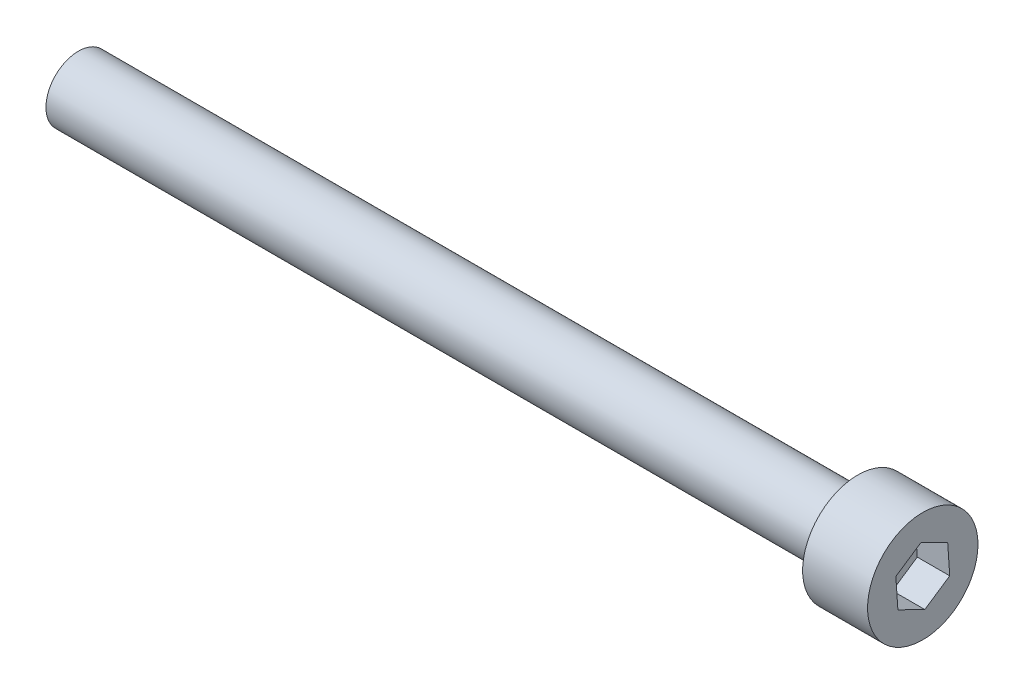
from build123d import *

# Parameters (mm, degrees)
ENL_V_MAT_EXTRU_1_DEPTH = 2.5


with BuildPart() as part:
    # Esquisse1 → R_volution1 (revolve)
    with BuildSketch(Plane.XY, mode=Mode.PRIVATE) as r_volution1_sk:
        Polygon((0, 0), (0, 4.25), (-5, 4.25), (-5, 2.5), (-65, 2.5), (-65, 0), align=None)
    revolve(r_volution1_sk.sketch.rotate(Axis((0, 0, 0), (-1, 0, 0)), 90), axis=Axis((0, 0, 0), (-1, 0, 0)))

    # Esquisse2 → Enl_v. mat.-Extru.1 (cut)
    with BuildSketch(Plane(origin=(0, 0, 0), x_dir=(0, 0, -1), z_dir=(1, 0, 0))):
        Polygon((2.073693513, -1.016429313), (1.917100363, 1.287656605), (-0.15659315, 2.304085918), (-2.073693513, 1.016429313), (-1.917100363, -1.287656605), (0.15659315, -2.304085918), align=None)
    extrude(amount=-ENL_V_MAT_EXTRU_1_DEPTH, mode=Mode.SUBTRACT)


solid = part.part
